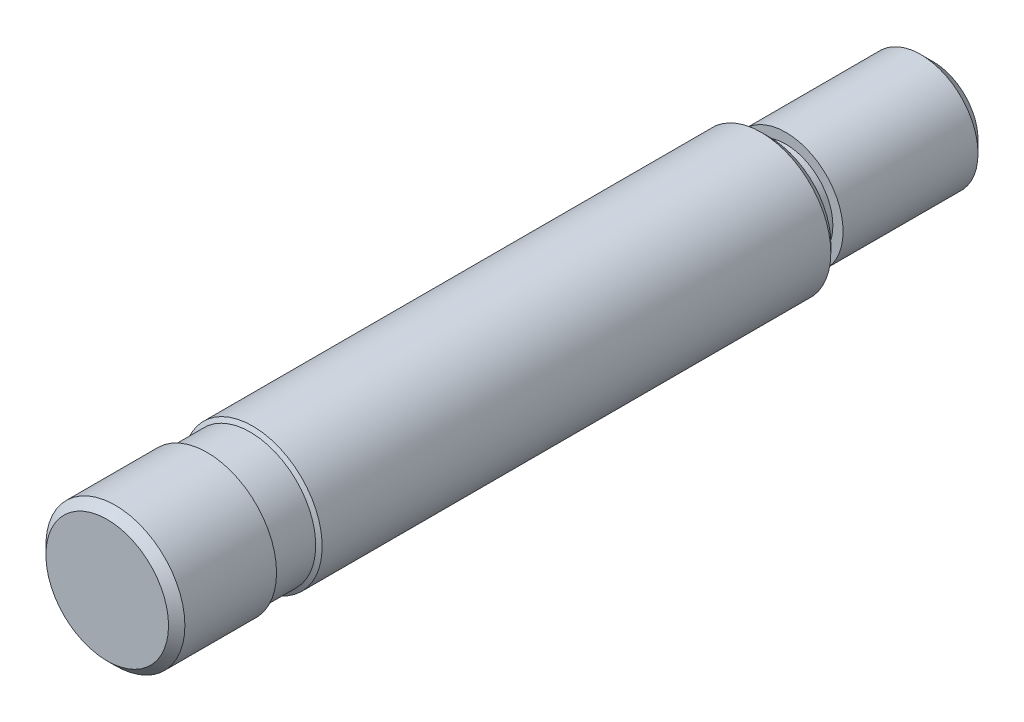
from build123d import *

# Parameters (mm, degrees)
ESQUISSE1_R          = 8.5
BASE_EXTRUSION_DEPTH = 81
ESQUISSE3_R          = 5.75
BOSS_EXTRU_2_DEPTH   = 2
ESQUISSE4_R          = 7
BOSS_EXTRU_3_DEPTH   = 18
CHANFREIN3_SIZE      = 1.5
CHANFREIN4_SIZE      = 1


with BuildPart() as part:
    # Esquisse1 → Base-Extrusion (new body)
    with BuildSketch(Plane.XY):
        with Locations(Location((0, 0, 0), (0, 0, 180))):
            Circle(ESQUISSE1_R)
    extrude(amount=BASE_EXTRUSION_DEPTH)

    # Esquisse3 → Boss.-Extru.2 (add)
    with BuildSketch(Plane(origin=(0, 0, 0), x_dir=(-1, 0, 0), z_dir=(0, 0, -1))):
        with Locations(Location((0, 0, 0), (0, 0, 180))):
            Circle(ESQUISSE3_R)
    extrude(amount=BOSS_EXTRU_2_DEPTH)

    # Esquisse4 → Boss.-Extru.3 (add)
    with BuildSketch(Plane(origin=(0, 0, -2), x_dir=(-1, 0, 0), z_dir=(0, 0, -1))):
        with Locations(Location((0, 0, 0), (0, 0, 180))):
            Circle(ESQUISSE4_R)
    extrude(amount=BOSS_EXTRU_3_DEPTH)

    # Chanfrein3
    chanfrein3_edges = [part.edges().sort_by_distance(p)[0] for p in [
        (-7, 0, -20),
    ]]
    chamfer(chanfrein3_edges, length=CHANFREIN3_SIZE)

    # Chanfrein4
    chanfrein4_edges = [part.edges().sort_by_distance(p)[0] for p in [
        (8.5, 0, 0),
        (8.5, 0, 81),
    ]]
    chamfer(chanfrein4_edges, length=CHANFREIN4_SIZE)

    # Esquisse5 → Enl_vement de mati_re-R_volution1 (revolve, cut)
    with BuildSketch(Plane(origin=(0, 0, 0), x_dir=(1, 0, 0), z_dir=(0, 1, 0)), mode=Mode.PRIVATE) as enl_vement_de_mati_re_r_volution1_sk:
        Polygon((-20.002037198, -56.570620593), (-8, -63.5), (-8, -68.5), (-20.002037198, -75.429379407), align=None)
    revolve(enl_vement_de_mati_re_r_volution1_sk.sketch.rotate(Axis((0, 0, 79), (0, 0, 1)), 180), axis=Axis((0, 0, 79), (0, 0, 1)), mode=Mode.SUBTRACT)


solid = part.part
